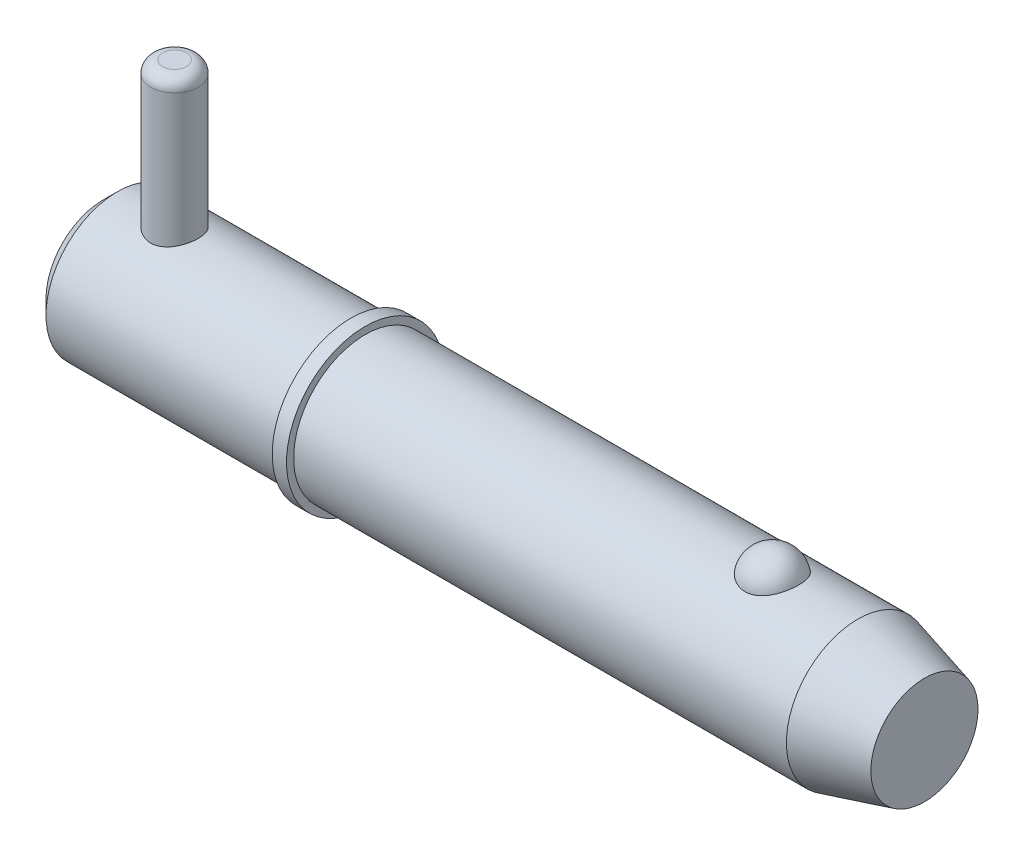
ISO-10303-21;
HEADER;
FILE_DESCRIPTION(('STEP AP214'),'2;1');
FILE_NAME('part.step','',(''),(''),'','','');
FILE_SCHEMA(('AUTOMOTIVE_DESIGN { 1 0 10303 214 1 1 1 1 }'));
ENDSEC;
DATA;
#1=APPLICATION_CONTEXT('core data for automotive mechanical design processes');
#2=APPLICATION_PROTOCOL_DEFINITION('international standard','automotive_design',2000,#1);
#3=PRODUCT_CONTEXT('',#1,'mechanical');
#4=PRODUCT('Part','Part','',(#3));
#5=PRODUCT_RELATED_PRODUCT_CATEGORY('part','',(#4));
#6=PRODUCT_DEFINITION_FORMATION('','',#4);
#7=PRODUCT_DEFINITION_CONTEXT('part definition',#1,'design');
#8=PRODUCT_DEFINITION('design','',#6,#7);
#9=PRODUCT_DEFINITION_SHAPE('','',#8);
#10=(LENGTH_UNIT() NAMED_UNIT(*) SI_UNIT(.MILLI.,.METRE.));
#11=(NAMED_UNIT(*) PLANE_ANGLE_UNIT() SI_UNIT($,.RADIAN.));
#12=(NAMED_UNIT(*) SI_UNIT($,.STERADIAN.) SOLID_ANGLE_UNIT());
#13=UNCERTAINTY_MEASURE_WITH_UNIT(LENGTH_MEASURE(1.E-05),#10,'distance_accuracy_value','');
#14=(GEOMETRIC_REPRESENTATION_CONTEXT(3) GLOBAL_UNCERTAINTY_ASSIGNED_CONTEXT((#13)) GLOBAL_UNIT_ASSIGNED_CONTEXT((#10,
#11,#12)) REPRESENTATION_CONTEXT('',''));
#15=CARTESIAN_POINT('',(0.,0.,0.));
#16=DIRECTION('',(0.,0.,1.));
#17=DIRECTION('',(1.,0.,0.));
#18=AXIS2_PLACEMENT_3D('',#15,#16,#17);
#19=CARTESIAN_POINT('',(9.525,28.575,0.));
#20=DIRECTION('',(0.,-1.,0.));
#21=DIRECTION('',(0.,0.,-1.));
#22=AXIS2_PLACEMENT_3D('',#19,#20,#21);
#23=CYLINDRICAL_SURFACE('',#22,3.175);
#24=CARTESIAN_POINT('',(9.525,-7.93750000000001,0.));
#25=DIRECTION('',(0.,1.,0.));
#26=DIRECTION('',(0.,0.,1.));
#27=AXIS2_PLACEMENT_3D('',#24,#25,#26);
#28=CIRCLE('',#27,3.175);
#29=CARTESIAN_POINT('',(9.525,-7.93750000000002,-3.175));
#30=VERTEX_POINT('',#29);
#31=EDGE_CURVE('P0_E25',#30,#30,#28,.T.);
#32=CARTESIAN_POINT('',(9.525,26.9875,0.));
#33=DIRECTION('',(0.,1.,0.));
#34=DIRECTION('',(0.,0.,1.));
#35=AXIS2_PLACEMENT_3D('',#32,#33,#34);
#36=CIRCLE('',#35,3.175);
#37=CARTESIAN_POINT('',(9.525,26.9875,-3.175));
#38=VERTEX_POINT('',#37);
#39=EDGE_CURVE('P0_E29',#38,#38,#36,.F.);
#40=CARTESIAN_POINT('',(9.525,-7.93750000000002,-3.175));
#41=CARTESIAN_POINT('',(9.525,-7.57369791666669,-3.175));
#42=CARTESIAN_POINT('',(9.525,-7.20989583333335,-3.175));
#43=CARTESIAN_POINT('',(9.525,-6.48229166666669,-3.175));
#44=CARTESIAN_POINT('',(9.525,-6.11848958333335,-3.175));
#45=CARTESIAN_POINT('',(9.525,-5.39088541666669,-3.175));
#46=CARTESIAN_POINT('',(9.525,-5.02708333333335,-3.175));
#47=CARTESIAN_POINT('',(9.525,-4.29947916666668,-3.175));
#48=CARTESIAN_POINT('',(9.525,-3.93567708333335,-3.175));
#49=CARTESIAN_POINT('',(9.525,-3.20807291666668,-3.175));
#50=CARTESIAN_POINT('',(9.525,-2.84427083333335,-3.175));
#51=CARTESIAN_POINT('',(9.525,-2.11666666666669,-3.175));
#52=CARTESIAN_POINT('',(9.525,-1.75286458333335,-3.175));
#53=CARTESIAN_POINT('',(9.525,-1.02526041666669,-3.175));
#54=CARTESIAN_POINT('',(9.525,-0.661458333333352,-3.175));
#55=CARTESIAN_POINT('',(9.525,0.0661458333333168,-3.175));
#56=CARTESIAN_POINT('',(9.525,0.429947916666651,-3.175));
#57=CARTESIAN_POINT('',(9.525,1.15755208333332,-3.175));
#58=CARTESIAN_POINT('',(9.525,1.52135416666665,-3.175));
#59=CARTESIAN_POINT('',(9.525,2.24895833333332,-3.175));
#60=CARTESIAN_POINT('',(9.525,2.61276041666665,-3.175));
#61=CARTESIAN_POINT('',(9.525,3.34036458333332,-3.175));
#62=CARTESIAN_POINT('',(9.525,3.70416666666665,-3.175));
#63=CARTESIAN_POINT('',(9.525,4.43177083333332,-3.175));
#64=CARTESIAN_POINT('',(9.525,4.79557291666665,-3.175));
#65=CARTESIAN_POINT('',(9.525,5.52317708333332,-3.175));
#66=CARTESIAN_POINT('',(9.525,5.88697916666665,-3.175));
#67=CARTESIAN_POINT('',(9.525,6.61458333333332,-3.175));
#68=CARTESIAN_POINT('',(9.525,6.97838541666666,-3.175));
#69=CARTESIAN_POINT('',(9.525,7.70598958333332,-3.175));
#70=CARTESIAN_POINT('',(9.525,8.06979166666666,-3.175));
#71=CARTESIAN_POINT('',(9.525,8.79739583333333,-3.175));
#72=CARTESIAN_POINT('',(9.525,9.16119791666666,-3.175));
#73=CARTESIAN_POINT('',(9.525,9.88880208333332,-3.175));
#74=CARTESIAN_POINT('',(9.525,10.2526041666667,-3.175));
#75=CARTESIAN_POINT('',(9.525,10.9802083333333,-3.175));
#76=CARTESIAN_POINT('',(9.525,11.3440104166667,-3.175));
#77=CARTESIAN_POINT('',(9.525,12.0716145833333,-3.175));
#78=CARTESIAN_POINT('',(9.525,12.4354166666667,-3.175));
#79=CARTESIAN_POINT('',(9.525,13.1630208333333,-3.175));
#80=CARTESIAN_POINT('',(9.525,13.5268229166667,-3.175));
#81=CARTESIAN_POINT('',(9.525,14.2544270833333,-3.175));
#82=CARTESIAN_POINT('',(9.525,14.6182291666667,-3.175));
#83=CARTESIAN_POINT('',(9.525,15.3458333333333,-3.175));
#84=CARTESIAN_POINT('',(9.525,15.7096354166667,-3.175));
#85=CARTESIAN_POINT('',(9.525,16.4372395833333,-3.175));
#86=CARTESIAN_POINT('',(9.525,16.8010416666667,-3.175));
#87=CARTESIAN_POINT('',(9.525,17.5286458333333,-3.175));
#88=CARTESIAN_POINT('',(9.525,17.8924479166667,-3.175));
#89=CARTESIAN_POINT('',(9.525,18.6200520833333,-3.175));
#90=CARTESIAN_POINT('',(9.525,18.9838541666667,-3.175));
#91=CARTESIAN_POINT('',(9.525,19.7114583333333,-3.175));
#92=CARTESIAN_POINT('',(9.525,20.0752604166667,-3.175));
#93=CARTESIAN_POINT('',(9.525,20.8028645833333,-3.175));
#94=CARTESIAN_POINT('',(9.525,21.1666666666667,-3.175));
#95=CARTESIAN_POINT('',(9.525,21.8942708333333,-3.175));
#96=CARTESIAN_POINT('',(9.525,22.2580729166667,-3.175));
#97=CARTESIAN_POINT('',(9.525,22.9856770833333,-3.175));
#98=CARTESIAN_POINT('',(9.525,23.3494791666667,-3.175));
#99=CARTESIAN_POINT('',(9.525,24.0770833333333,-3.175));
#100=CARTESIAN_POINT('',(9.525,24.4408854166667,-3.175));
#101=CARTESIAN_POINT('',(9.525,25.1684895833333,-3.175));
#102=CARTESIAN_POINT('',(9.525,25.5322916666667,-3.175));
#103=CARTESIAN_POINT('',(9.525,26.2598958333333,-3.175));
#104=CARTESIAN_POINT('',(9.525,26.6236979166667,-3.175));
#105=CARTESIAN_POINT('',(9.525,26.9875,-3.175));
#106=B_SPLINE_CURVE_WITH_KNOTS('',3,(#40,#41,#42,#43,#44,#45,#46,#47,#48,#49,#50,#51,#52,#53,
#54,#55,#56,#57,#58,#59,#60,#61,#62,#63,#64,#65,#66,#67,#68,#69,#70,#71,#72,#73,#74,#75,#76,#77,
#78,#79,#80,#81,#82,#83,#84,#85,#86,#87,#88,#89,#90,#91,#92,#93,#94,#95,#96,#97,#98,#99,#100,
#101,#102,#103,#104,#105),.UNSPECIFIED.,.F.,.F.,(4,2,2,2,2,2,2,2,2,2,2,2,2,2,2,2,2,2,2,2,2,2,2,
2,2,2,2,2,2,2,2,2,4),(0.,1.09140625,2.1828125,3.27421875,4.365625,5.45703125,6.5484375,
7.63984375,8.73125000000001,9.82265625,10.9140625,12.00546875,13.096875,14.18828125,15.2796875,
16.37109375,17.4625,18.55390625,19.6453125,20.73671875,21.828125,22.91953125,24.0109375,
25.10234375,26.19375,27.28515625,28.3765625,29.46796875,30.559375,31.65078125,32.7421875,
33.83359375,34.925),.UNSPECIFIED.);
#107=EDGE_CURVE('P0_BSEAM14',#30,#38,#106,.T.);
#108=ORIENTED_EDGE('',*,*,#31,.T.);
#109=ORIENTED_EDGE('',*,*,#39,.T.);
#110=ORIENTED_EDGE('',*,*,#107,.T.);
#111=ORIENTED_EDGE('',*,*,#107,.F.);
#112=EDGE_LOOP('',(#108,#110,#109,#111));
#113=FACE_BOUND('',#112,.T.);
#114=ADVANCED_FACE('P0_F14',(#113),#23,.T.);
#115=CARTESIAN_POINT('',(9.525,28.575,0.));
#116=DIRECTION('',(0.,1.,0.));
#117=DIRECTION('',(0.,0.,1.));
#118=AXIS2_PLACEMENT_3D('',#115,#116,#117);
#119=PLANE('',#118);
#120=CARTESIAN_POINT('',(9.525,28.575,0.));
#121=DIRECTION('',(0.,1.,0.));
#122=DIRECTION('',(0.,0.,1.));
#123=AXIS2_PLACEMENT_3D('',#120,#121,#122);
#124=CIRCLE('',#123,1.5875);
#125=CARTESIAN_POINT('',(9.525,28.575,1.5875));
#126=VERTEX_POINT('',#125);
#127=EDGE_CURVE('P0_E10',#126,#126,#124,.T.);
#128=ORIENTED_EDGE('',*,*,#127,.T.);
#129=EDGE_LOOP('',(#128));
#130=FACE_BOUND('',#129,.T.);
#131=ADVANCED_FACE('P0_F46',(#130),#119,.T.);
#132=CARTESIAN_POINT('',(9.525,-9.525,0.));
#133=DIRECTION('',(0.,1.,0.));
#134=DIRECTION('',(0.,0.,1.));
#135=AXIS2_PLACEMENT_3D('',#132,#133,#134);
#136=PLANE('',#135);
#137=CARTESIAN_POINT('',(9.525,-9.525,0.));
#138=DIRECTION('',(0.,1.,0.));
#139=DIRECTION('',(0.,0.,1.));
#140=AXIS2_PLACEMENT_3D('',#137,#138,#139);
#141=CIRCLE('',#140,1.5875);
#142=CARTESIAN_POINT('',(9.525,-9.525,1.5875));
#143=VERTEX_POINT('',#142);
#144=EDGE_CURVE('P0_E21',#143,#143,#141,.F.);
#145=ORIENTED_EDGE('',*,*,#144,.T.);
#146=EDGE_LOOP('',(#145));
#147=FACE_BOUND('',#146,.T.);
#148=ADVANCED_FACE('P0_F43',(#147),#136,.F.);
#149=CARTESIAN_POINT('',(9.525,-7.9375,0.));
#150=DIRECTION('',(0.,1.,0.));
#151=DIRECTION('',(0.,0.,1.));
#152=AXIS2_PLACEMENT_3D('',#149,#150,#151);
#153=DEGENERATE_TOROIDAL_SURFACE('',#152,1.5875,1.5875,.T.);
#154=ORIENTED_EDGE('',*,*,#144,.F.);
#155=EDGE_LOOP('',(#154));
#156=FACE_BOUND('',#155,.T.);
#157=ORIENTED_EDGE('',*,*,#31,.F.);
#158=EDGE_LOOP('',(#157));
#159=FACE_BOUND('',#158,.T.);
#160=ADVANCED_FACE('P0_F38',(#156,#159),#153,.T.);
#161=CARTESIAN_POINT('',(9.525,26.9875,0.));
#162=DIRECTION('',(0.,1.,0.));
#163=DIRECTION('',(0.,0.,1.));
#164=AXIS2_PLACEMENT_3D('',#161,#162,#163);
#165=DEGENERATE_TOROIDAL_SURFACE('',#164,1.5875,1.5875,.T.);
#166=ORIENTED_EDGE('',*,*,#39,.F.);
#167=EDGE_LOOP('',(#166));
#168=FACE_BOUND('',#167,.T.);
#169=ORIENTED_EDGE('',*,*,#127,.F.);
#170=EDGE_LOOP('',(#169));
#171=FACE_BOUND('',#170,.T.);
#172=ADVANCED_FACE('P0_F16',(#168,#171),#165,.T.);
#173=CLOSED_SHELL('',(#114,#131,#148,#160,#172));
#174=MANIFOLD_SOLID_BREP('P0_B1',#173);
#175=CARTESIAN_POINT('',(0.,0.,0.));
#176=DIRECTION('',(1.,0.,0.));
#177=DIRECTION('',(0.,0.,-1.));
#178=AXIS2_PLACEMENT_3D('',#175,#176,#177);
#179=CYLINDRICAL_SURFACE('',#178,9.525);
#180=CARTESIAN_POINT('',(100.643054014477,0.,0.));
#181=DIRECTION('',(1.,0.,0.));
#182=DIRECTION('',(0.,0.,-1.));
#183=AXIS2_PLACEMENT_3D('',#180,#181,#182);
#184=CIRCLE('',#183,9.525);
#185=CARTESIAN_POINT('',(100.643054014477,0.,-9.525));
#186=VERTEX_POINT('',#185);
#187=EDGE_CURVE('P1_E81',#186,#186,#184,.T.);
#188=ORIENTED_EDGE('',*,*,#187,.F.);
#189=EDGE_LOOP('',(#188));
#190=FACE_BOUND('',#189,.T.);
#191=CARTESIAN_POINT('',(34.93,0.,0.));
#192=DIRECTION('',(1.,0.,0.));
#193=DIRECTION('',(0.,0.,-1.));
#194=AXIS2_PLACEMENT_3D('',#191,#192,#193);
#195=CIRCLE('',#194,9.525);
#196=CARTESIAN_POINT('',(34.93,0.,-9.525));
#197=VERTEX_POINT('',#196);
#198=EDGE_CURVE('P1_E85',#197,#197,#195,.T.);
#199=ORIENTED_EDGE('',*,*,#198,.T.);
#200=EDGE_LOOP('',(#199));
#201=FACE_BOUND('',#200,.T.);
#202=CARTESIAN_POINT('',(89.2457573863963,8.80405803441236,3.63513233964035));
#203=CARTESIAN_POINT('',(89.1516766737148,8.80405953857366,3.63513053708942));
#204=CARTESIAN_POINT('',(89.0575618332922,8.80561325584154,3.6313746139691));
#205=CARTESIAN_POINT('',(88.8700126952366,8.81177748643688,3.61638665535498));
#206=CARTESIAN_POINT('',(88.7765788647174,8.81638992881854,3.60514990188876));
#207=CARTESIAN_POINT('',(88.4979452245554,8.8346711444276,3.56024627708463));
#208=CARTESIAN_POINT('',(88.3146916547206,8.85278327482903,3.51538626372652));
#209=CARTESIAN_POINT('',(87.9595099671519,8.89871214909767,3.39742145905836));
#210=CARTESIAN_POINT('',(87.7875533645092,8.9265032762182,3.32439116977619));
#211=CARTESIAN_POINT('',(87.458707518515,8.98874819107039,3.15220244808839));
#212=CARTESIAN_POINT('',(87.3018114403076,9.02319893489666,3.05305594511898));
#213=CARTESIAN_POINT('',(87.0022147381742,9.09629186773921,2.82797815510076));
#214=CARTESIAN_POINT('',(86.8600600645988,9.13502685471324,2.7013513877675));
#215=CARTESIAN_POINT('',(86.5982999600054,9.2118657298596,2.4264193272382));
#216=CARTESIAN_POINT('',(86.4787015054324,9.2499694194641,2.27810735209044));
#217=CARTESIAN_POINT('',(86.259645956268,9.3234108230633,1.95652290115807));
#218=CARTESIAN_POINT('',(86.1613174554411,9.35855090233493,1.78243511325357));
#219=CARTESIAN_POINT('',(85.9938190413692,9.42045142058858,1.41937246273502));
#220=CARTESIAN_POINT('',(85.9246511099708,9.44721128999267,1.23039658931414));
#221=CARTESIAN_POINT('',(85.8161994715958,9.48990641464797,0.840370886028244));
#222=CARTESIAN_POINT('',(85.7772880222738,9.50570658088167,0.639202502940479));
#223=CARTESIAN_POINT('',(85.7315550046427,9.52433146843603,0.232664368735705));
#224=CARTESIAN_POINT('',(85.7247324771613,9.52715657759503,0.0272947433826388));
#225=CARTESIAN_POINT('',(85.743255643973,9.51956918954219,-0.380478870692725));
#226=CARTESIAN_POINT('',(85.7684052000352,9.50923740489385,-0.58289331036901));
#227=CARTESIAN_POINT('',(85.8500253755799,9.47651897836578,-0.980293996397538));
#228=CARTESIAN_POINT('',(85.9064966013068,9.45413210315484,-1.17528009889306));
#229=CARTESIAN_POINT('',(86.0497192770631,9.39954044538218,-1.55263697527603));
#230=CARTESIAN_POINT('',(86.1365124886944,9.36732213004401,-1.73498993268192));
#231=CARTESIAN_POINT('',(86.3386103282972,9.29640700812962,-2.08177763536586));
#232=CARTESIAN_POINT('',(86.4539172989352,9.25770966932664,-2.24621090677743));
#233=CARTESIAN_POINT('',(86.711264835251,9.17775604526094,-2.5533833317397));
#234=CARTESIAN_POINT('',(86.8534344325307,9.136488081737,-2.696011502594));
#235=CARTESIAN_POINT('',(87.16089985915,9.05620497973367,-2.95451229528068));
#236=CARTESIAN_POINT('',(87.3261937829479,9.01718965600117,-3.07038711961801));
#237=CARTESIAN_POINT('',(87.672052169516,8.9468001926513,-3.26976836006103));
#238=CARTESIAN_POINT('',(87.8522278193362,8.91528408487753,-3.35389750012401));
#239=CARTESIAN_POINT('',(88.2256514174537,8.86272514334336,-3.49043503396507));
#240=CARTESIAN_POINT('',(88.4188944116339,8.8416783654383,-3.54285537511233));
#241=CARTESIAN_POINT('',(88.8025036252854,8.81348056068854,-3.61241306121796));
#242=CARTESIAN_POINT('',(88.9925251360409,8.80568348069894,-3.63119339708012));
#243=CARTESIAN_POINT('',(89.3731906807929,8.80289410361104,-3.63795342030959));
#244=CARTESIAN_POINT('',(89.5638345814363,8.80789922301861,-3.62593932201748));
#245=CARTESIAN_POINT('',(89.9340076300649,8.8297491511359,-3.57238430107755));
#246=CARTESIAN_POINT('',(90.1136976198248,8.84621463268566,-3.53178890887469));
#247=CARTESIAN_POINT('',(90.463422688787,8.88875330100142,-3.42331083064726));
#248=CARTESIAN_POINT('',(90.6334569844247,8.91482726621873,-3.35542593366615));
#249=CARTESIAN_POINT('',(90.9632377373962,8.97448239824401,-3.19248225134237));
#250=CARTESIAN_POINT('',(91.1226801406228,9.00821446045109,-3.09686474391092));
#251=CARTESIAN_POINT('',(91.4235136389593,9.07935398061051,-2.88162736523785));
#252=CARTESIAN_POINT('',(91.5649005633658,9.11676228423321,-2.76200196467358));
#253=CARTESIAN_POINT('',(91.8333193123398,9.19347419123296,-2.49516285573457));
#254=CARTESIAN_POINT('',(91.9592750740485,9.23277872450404,-2.34686614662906));
#255=CARTESIAN_POINT('',(92.1855227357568,9.30737610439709,-2.03093683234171));
#256=CARTESIAN_POINT('',(92.2858100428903,9.34266823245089,-1.86330077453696));
#257=CARTESIAN_POINT('',(92.4615149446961,9.40674710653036,-1.50744893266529));
#258=CARTESIAN_POINT('',(92.536041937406,9.4352917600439,-1.31874876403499));
#259=CARTESIAN_POINT('',(92.6541650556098,9.48144132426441,-0.930631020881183));
#260=CARTESIAN_POINT('',(92.6977608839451,9.49904612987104,-0.731213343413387));
#261=CARTESIAN_POINT('',(92.7531580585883,9.5215314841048,-0.327147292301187));
#262=CARTESIAN_POINT('',(92.7649354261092,9.52640243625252,-0.122495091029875));
#263=CARTESIAN_POINT('',(92.7563825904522,9.52289571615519,0.286018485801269));
#264=CARTESIAN_POINT('',(92.7360530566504,9.51451832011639,0.489879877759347));
#265=CARTESIAN_POINT('',(92.6638840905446,9.48544083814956,0.88999431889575));
#266=CARTESIAN_POINT('',(92.6121993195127,9.46480124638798,1.08627971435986));
#267=CARTESIAN_POINT('',(92.4784917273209,9.4133389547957,1.46682086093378));
#268=CARTESIAN_POINT('',(92.3964668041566,9.38251554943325,1.65107577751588));
#269=CARTESIAN_POINT('',(92.2031929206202,9.31365636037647,2.00346348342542));
#270=CARTESIAN_POINT('',(92.0917838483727,9.27558138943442,2.17150083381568));
#271=CARTESIAN_POINT('',(91.8422947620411,9.19638714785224,2.48563115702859));
#272=CARTESIAN_POINT('',(91.7042163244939,9.15526805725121,2.63172542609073));
#273=CARTESIAN_POINT('',(91.4048438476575,9.07465393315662,2.89750997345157));
#274=CARTESIAN_POINT('',(91.2436109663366,9.03515496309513,3.01726776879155));
#275=CARTESIAN_POINT('',(90.9016136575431,8.96227564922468,3.22732920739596));
#276=CARTESIAN_POINT('',(90.720841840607,8.92889763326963,3.31762165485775));
#277=CARTESIAN_POINT('',(90.3514451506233,8.8734538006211,3.46314419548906));
#278=CARTESIAN_POINT('',(90.1633237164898,8.85102983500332,3.51950082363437));
#279=CARTESIAN_POINT('',(89.8757869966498,8.8266696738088,3.57993683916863));
#280=CARTESIAN_POINT('',(89.7791339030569,8.82009725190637,3.59606217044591));
#281=CARTESIAN_POINT('',(89.5846770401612,8.81020897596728,3.62022512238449));
#282=CARTESIAN_POINT('',(89.4868741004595,8.80689090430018,3.62826825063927));
#283=CARTESIAN_POINT('',(89.3412243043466,8.80445615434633,3.63416760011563));
#284=CARTESIAN_POINT('',(89.2934952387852,8.80405727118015,3.63513325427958));
#285=CARTESIAN_POINT('',(89.2457573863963,8.80405803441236,3.63513233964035));
#286=B_SPLINE_CURVE_WITH_KNOTS('',3,(#202,#203,#204,#205,#206,#207,#208,#209,#210,#211,#212,
#213,#214,#215,#216,#217,#218,#219,#220,#221,#222,#223,#224,#225,#226,#227,#228,#229,#230,#231,
#232,#233,#234,#235,#236,#237,#238,#239,#240,#241,#242,#243,#244,#245,#246,#247,#248,#249,#250,
#251,#252,#253,#254,#255,#256,#257,#258,#259,#260,#261,#262,#263,#264,#265,#266,#267,#268,#269,
#270,#271,#272,#273,#274,#275,#276,#277,#278,#279,#280,#281,#282,#283,#284,#285),.UNSPECIFIED.,
.T.,.F.,(4,2,2,2,2,2,2,2,2,2,2,2,2,2,2,2,2,2,2,2,2,2,2,2,2,2,2,2,2,2,2,2,2,2,2,2,2,2,2,2,2,4),
(0.,0.282202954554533,0.564584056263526,1.13017050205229,1.69427128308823,2.258114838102,
2.83836627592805,3.41879688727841,4.02497117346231,4.63118665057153,5.24474754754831,
5.85829010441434,6.46808687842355,7.07789545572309,7.68854723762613,8.29924920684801,
8.91296283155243,9.52662591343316,10.1275338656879,10.7282152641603,11.2986646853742,
11.868998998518,12.4213015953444,12.973648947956,13.5380053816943,14.1024919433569,
14.695298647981,15.2882113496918,15.8999469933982,16.5116885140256,17.1238909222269,
17.7360805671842,18.3452748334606,18.9545113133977,19.567138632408,20.1797297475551,
20.7907316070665,21.4019653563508,21.9915938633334,22.2859053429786,22.5800161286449,
22.723209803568),.UNSPECIFIED.);
#287=CARTESIAN_POINT('',(89.2457573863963,8.80405803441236,3.63513233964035));
#288=VERTEX_POINT('',#287);
#289=EDGE_CURVE('P1_E35',#288,#288,#286,.T.);
#290=ORIENTED_EDGE('',*,*,#289,.T.);
#291=EDGE_LOOP('',(#290));
#292=FACE_BOUND('',#291,.T.);
#293=ADVANCED_FACE('P1_F13',(#190,#201,#292),#179,.T.);
#294=CARTESIAN_POINT('',(0.,0.,0.));
#295=DIRECTION('',(-1.,0.,0.));
#296=DIRECTION('',(0.,0.,1.));
#297=AXIS2_PLACEMENT_3D('',#294,#295,#296);
#298=PLANE('',#297);
#299=CARTESIAN_POINT('',(0.,0.,0.));
#300=DIRECTION('',(1.,0.,0.));
#301=DIRECTION('',(0.,0.,-1.));
#302=AXIS2_PLACEMENT_3D('',#299,#300,#301);
#303=CIRCLE('',#302,7.62);
#304=CARTESIAN_POINT('',(0.,0.,-7.62));
#305=VERTEX_POINT('',#304);
#306=EDGE_CURVE('P1_E9',#305,#305,#303,.T.);
#307=ORIENTED_EDGE('',*,*,#306,.F.);
#308=EDGE_LOOP('',(#307));
#309=FACE_BOUND('',#308,.T.);
#310=ADVANCED_FACE('P1_F15',(#309),#298,.T.);
#311=CARTESIAN_POINT('',(1.90499999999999,0.,0.));
#312=DIRECTION('',(1.,0.,0.));
#313=DIRECTION('',(0.,0.,-1.));
#314=AXIS2_PLACEMENT_3D('',#311,#312,#313);
#315=CONICAL_SURFACE('',#314,9.525,0.785398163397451);
#316=ORIENTED_EDGE('',*,*,#306,.T.);
#317=EDGE_LOOP('',(#316));
#318=FACE_BOUND('',#317,.T.);
#319=CARTESIAN_POINT('',(1.90499999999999,0.,0.));
#320=DIRECTION('',(1.,0.,0.));
#321=DIRECTION('',(0.,0.,-1.));
#322=AXIS2_PLACEMENT_3D('',#319,#320,#321);
#323=CIRCLE('',#322,9.525);
#324=CARTESIAN_POINT('',(1.90499999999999,0.,-9.525));
#325=VERTEX_POINT('',#324);
#326=EDGE_CURVE('P1_E26',#325,#325,#323,.T.);
#327=ORIENTED_EDGE('',*,*,#326,.F.);
#328=EDGE_LOOP('',(#327));
#329=FACE_BOUND('',#328,.T.);
#330=ADVANCED_FACE('P1_F77',(#318,#329),#315,.T.);
#331=CARTESIAN_POINT('',(0.,0.,0.));
#332=DIRECTION('',(1.,0.,0.));
#333=DIRECTION('',(0.,0.,-1.));
#334=AXIS2_PLACEMENT_3D('',#331,#332,#333);
#335=CYLINDRICAL_SURFACE('',#334,9.525);
#336=CARTESIAN_POINT('',(9.525,-8.98025612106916,3.175));
#337=CARTESIAN_POINT('',(9.35206354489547,-8.98025555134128,3.17500081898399));
#338=CARTESIAN_POINT('',(9.17913201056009,-8.98530617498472,3.16082293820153));
#339=CARTESIAN_POINT('',(8.83839221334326,-9.00485797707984,3.10467734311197));
#340=CARTESIAN_POINT('',(8.67058479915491,-9.0193607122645,3.06270505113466));
#341=CARTESIAN_POINT('',(8.34508461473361,-9.05599546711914,2.95260866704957));
#342=CARTESIAN_POINT('',(8.18737272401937,-9.07811252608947,2.88453582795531));
#343=CARTESIAN_POINT('',(7.88555684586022,-9.12746212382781,2.72434567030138));
#344=CARTESIAN_POINT('',(7.74145587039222,-9.1546957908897,2.63222304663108));
#345=CARTESIAN_POINT('',(7.46531411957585,-9.21240503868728,2.42268738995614));
#346=CARTESIAN_POINT('',(7.33388351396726,-9.24296141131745,2.30449228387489));
#347=CARTESIAN_POINT('',(7.09229340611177,-9.30319020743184,2.0478358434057));
#348=CARTESIAN_POINT('',(6.98213731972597,-9.33286248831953,1.90937126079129));
#349=CARTESIAN_POINT('',(6.78345450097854,-9.38891527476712,1.61164431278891));
#350=CARTESIAN_POINT('',(6.69556709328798,-9.41518969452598,1.45193356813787));
#351=CARTESIAN_POINT('',(6.54814671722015,-9.46053437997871,1.11896913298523));
#352=CARTESIAN_POINT('',(6.48860610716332,-9.47960658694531,0.945719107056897));
#353=CARTESIAN_POINT('',(6.40163866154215,-9.50782564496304,0.596991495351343));
#354=CARTESIAN_POINT('',(6.373166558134,-9.5172947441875,0.421801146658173));
#355=CARTESIAN_POINT('',(6.3458207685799,-9.52638456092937,0.068890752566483));
#356=CARTESIAN_POINT('',(6.34693945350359,-9.52600781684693,-0.108828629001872));
#357=CARTESIAN_POINT('',(6.37808050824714,-9.51566675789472,-0.454353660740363));
#358=CARTESIAN_POINT('',(6.4069675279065,-9.50607905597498,-0.622274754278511));
#359=CARTESIAN_POINT('',(6.490947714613,-9.47886621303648,-0.950732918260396));
#360=CARTESIAN_POINT('',(6.54604265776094,-9.46124052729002,-1.11126948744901));
#361=CARTESIAN_POINT('',(6.68153768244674,-9.41945253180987,-1.42288410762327));
#362=CARTESIAN_POINT('',(6.76226085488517,-9.3952073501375,-1.57381010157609));
#363=CARTESIAN_POINT('',(6.94645456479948,-9.34270397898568,-1.86030973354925));
#364=CARTESIAN_POINT('',(7.04993142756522,-9.31444467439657,-1.99587908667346));
#365=CARTESIAN_POINT('',(7.28241619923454,-9.25532159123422,-2.2545702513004));
#366=CARTESIAN_POINT('',(7.4123967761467,-9.22439783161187,-2.37680549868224));
#367=CARTESIAN_POINT('',(7.69127470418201,-9.1645528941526,-2.5980302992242));
#368=CARTESIAN_POINT('',(7.84017496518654,-9.13563202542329,-2.6970162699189));
#369=CARTESIAN_POINT('',(8.15547526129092,-9.08273917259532,-2.87016016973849));
#370=CARTESIAN_POINT('',(8.32209451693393,-9.05884361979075,-2.94394402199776));
#371=CARTESIAN_POINT('',(8.66638917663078,-9.01959241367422,-3.06210713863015));
#372=CARTESIAN_POINT('',(8.84405991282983,-9.00423318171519,-3.10649872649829));
#373=CARTESIAN_POINT('',(9.19682677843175,-8.98460345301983,-3.16281207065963));
#374=CARTESIAN_POINT('',(9.37167742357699,-8.9798639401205,-3.17610837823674));
#375=CARTESIAN_POINT('',(9.72113927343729,-8.9806993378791,-3.17374726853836));
#376=CARTESIAN_POINT('',(9.89575051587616,-8.98627237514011,-3.15809511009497));
#377=CARTESIAN_POINT('',(10.2335233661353,-9.00663737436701,-3.09951644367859));
#378=CARTESIAN_POINT('',(10.3968722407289,-9.02110608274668,-3.05754530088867));
#379=CARTESIAN_POINT('',(10.7141759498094,-9.05727657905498,-2.94866651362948));
#380=CARTESIAN_POINT('',(10.8681291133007,-9.07897964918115,-2.88175444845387));
#381=CARTESIAN_POINT('',(11.1676828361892,-9.12802586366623,-2.72248103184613));
#382=CARTESIAN_POINT('',(11.3128635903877,-9.1555260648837,-2.62937980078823));
#383=CARTESIAN_POINT('',(11.5860387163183,-9.21276315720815,-2.42120937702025));
#384=CARTESIAN_POINT('',(11.7140280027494,-9.24250070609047,-2.30613370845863));
#385=CARTESIAN_POINT('',(11.9555513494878,-9.30259247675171,-2.05070616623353));
#386=CARTESIAN_POINT('',(12.0680936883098,-9.33290753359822,-1.90940458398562));
#387=CARTESIAN_POINT('',(12.267933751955,-9.3893275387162,-1.60917665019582));
#388=CARTESIAN_POINT('',(12.3552323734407,-9.41543263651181,-1.45025092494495));
#389=CARTESIAN_POINT('',(12.5013088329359,-9.46036988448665,-1.12007606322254));
#390=CARTESIAN_POINT('',(12.5602723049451,-9.47924920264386,-0.9489158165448));
#391=CARTESIAN_POINT('',(12.6483355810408,-9.50781089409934,-0.598355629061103));
#392=CARTESIAN_POINT('',(12.6774461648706,-9.5174965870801,-0.4189586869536));
#393=CARTESIAN_POINT('',(12.7040070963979,-9.52632915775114,-0.066088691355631));
#394=CARTESIAN_POINT('',(12.7028811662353,-9.52594996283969,0.107266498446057));
#395=CARTESIAN_POINT('',(12.6725130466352,-9.51586223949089,0.451202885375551));
#396=CARTESIAN_POINT('',(12.643273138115,-9.50615446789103,0.621784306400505));
#397=CARTESIAN_POINT('',(12.5584514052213,-9.47867404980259,0.952633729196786));
#398=CARTESIAN_POINT('',(12.5032953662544,-9.46103195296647,1.1130225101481));
#399=CARTESIAN_POINT('',(12.3686013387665,-9.41949985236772,1.42233126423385));
#400=CARTESIAN_POINT('',(12.2890589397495,-9.39560871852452,1.57124915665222));
#401=CARTESIAN_POINT('',(12.1044667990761,-9.34294133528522,1.85938800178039));
#402=CARTESIAN_POINT('',(11.9985831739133,-9.31401720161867,1.9980473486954));
#403=CARTESIAN_POINT('',(11.7657327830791,-9.25490239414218,2.25609475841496));
#404=CARTESIAN_POINT('',(11.6387592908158,-9.22471131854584,2.37547664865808));
#405=CARTESIAN_POINT('',(11.3613902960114,-9.16505913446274,2.59633024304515));
#406=CARTESIAN_POINT('',(11.2102725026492,-9.13567286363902,2.69691791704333));
#407=CARTESIAN_POINT('',(10.8923631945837,-9.08241113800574,2.87119803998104));
#408=CARTESIAN_POINT('',(10.7255757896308,-9.05853424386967,2.94489751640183));
#409=CARTESIAN_POINT('',(10.3887212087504,-9.02021736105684,3.06020415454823));
#410=CARTESIAN_POINT('',(10.219143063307,-9.00539959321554,3.10311136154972));
#411=CARTESIAN_POINT('',(9.87470703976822,-8.98542092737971,3.16050396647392));
#412=CARTESIAN_POINT('',(9.699851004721,-8.98025669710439,3.17499917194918));
#413=CARTESIAN_POINT('',(9.525,-8.98025612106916,3.175));
#414=B_SPLINE_CURVE_WITH_KNOTS('',3,(#336,#337,#338,#339,#340,#341,#342,#343,#344,#345,#346,
#347,#348,#349,#350,#351,#352,#353,#354,#355,#356,#357,#358,#359,#360,#361,#362,#363,#364,#365,
#366,#367,#368,#369,#370,#371,#372,#373,#374,#375,#376,#377,#378,#379,#380,#381,#382,#383,#384,
#385,#386,#387,#388,#389,#390,#391,#392,#393,#394,#395,#396,#397,#398,#399,#400,#401,#402,#403,
#404,#405,#406,#407,#408,#409,#410,#411,#412,#413),.UNSPECIFIED.,.T.,.F.,(4,2,2,2,2,2,2,2,2,2,2,
2,2,2,2,2,2,2,2,2,2,2,2,2,2,2,2,2,2,2,2,2,2,2,2,2,2,2,4),(0.,0.518161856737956,1.03640907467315,
1.55364379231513,2.07099270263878,2.60671746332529,3.14252816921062,3.69231882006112,
4.24196117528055,4.77247962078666,5.30286129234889,5.81244090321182,6.32205505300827,
6.83836754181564,7.3548237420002,7.89559553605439,8.43645060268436,8.98501631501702,
9.53335188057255,10.056948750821,10.5804505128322,11.0859695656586,11.5915782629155,
12.1132237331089,12.6350231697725,13.1819271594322,13.7288117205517,14.2720628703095,
14.815117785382,15.3326491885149,15.8501386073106,16.3594083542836,16.868770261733,
17.3969527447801,17.925304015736,18.4743376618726,19.023227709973,19.5473069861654,
20.0712053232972),.UNSPECIFIED.);
#415=CARTESIAN_POINT('',(9.525,-8.98025612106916,3.175));
#416=VERTEX_POINT('',#415);
#417=EDGE_CURVE('P1_E17',#416,#416,#414,.T.);
#418=ORIENTED_EDGE('',*,*,#417,.F.);
#419=EDGE_LOOP('',(#418));
#420=FACE_BOUND('',#419,.T.);
#421=CARTESIAN_POINT('',(9.525,8.98025612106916,3.175));
#422=CARTESIAN_POINT('',(9.69793645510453,8.98025555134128,3.17500081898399));
#423=CARTESIAN_POINT('',(9.87086798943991,8.98530617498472,3.16082293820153));
#424=CARTESIAN_POINT('',(10.2116077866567,9.00485797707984,3.10467734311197));
#425=CARTESIAN_POINT('',(10.3794152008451,9.0193607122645,3.06270505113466));
#426=CARTESIAN_POINT('',(10.7049153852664,9.05599546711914,2.95260866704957));
#427=CARTESIAN_POINT('',(10.8626272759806,9.07811252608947,2.88453582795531));
#428=CARTESIAN_POINT('',(11.1644431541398,9.12746212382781,2.72434567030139));
#429=CARTESIAN_POINT('',(11.3085441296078,9.15469579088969,2.63222304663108));
#430=CARTESIAN_POINT('',(11.5846858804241,9.21240503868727,2.42268738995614));
#431=CARTESIAN_POINT('',(11.7161164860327,9.24296141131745,2.30449228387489));
#432=CARTESIAN_POINT('',(11.9577065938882,9.30319020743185,2.0478358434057));
#433=CARTESIAN_POINT('',(12.067862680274,9.33286248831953,1.90937126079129));
#434=CARTESIAN_POINT('',(12.2665454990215,9.38891527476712,1.61164431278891));
#435=CARTESIAN_POINT('',(12.354432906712,9.41518969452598,1.45193356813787));
#436=CARTESIAN_POINT('',(12.5018532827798,9.46053437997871,1.11896913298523));
#437=CARTESIAN_POINT('',(12.5613938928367,9.47960658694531,0.945719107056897));
#438=CARTESIAN_POINT('',(12.6483613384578,9.50782564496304,0.596991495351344));
#439=CARTESIAN_POINT('',(12.676833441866,9.5172947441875,0.421801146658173));
#440=CARTESIAN_POINT('',(12.7041792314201,9.52638456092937,0.0688907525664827));
#441=CARTESIAN_POINT('',(12.7030605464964,9.52600781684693,-0.108828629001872));
#442=CARTESIAN_POINT('',(12.6719194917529,9.51566675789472,-0.454353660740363));
#443=CARTESIAN_POINT('',(12.6430324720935,9.50607905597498,-0.622274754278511));
#444=CARTESIAN_POINT('',(12.559052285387,9.47886621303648,-0.950732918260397));
#445=CARTESIAN_POINT('',(12.5039573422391,9.46124052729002,-1.11126948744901));
#446=CARTESIAN_POINT('',(12.3684623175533,9.41945253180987,-1.42288410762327));
#447=CARTESIAN_POINT('',(12.2877391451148,9.3952073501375,-1.57381010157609));
#448=CARTESIAN_POINT('',(12.1035454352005,9.34270397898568,-1.86030973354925));
#449=CARTESIAN_POINT('',(12.0000685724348,9.31444467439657,-1.99587908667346));
#450=CARTESIAN_POINT('',(11.7675838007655,9.25532159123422,-2.2545702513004));
#451=CARTESIAN_POINT('',(11.6376032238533,9.22439783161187,-2.37680549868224));
#452=CARTESIAN_POINT('',(11.358725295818,9.1645528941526,-2.5980302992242));
#453=CARTESIAN_POINT('',(11.2098250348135,9.13563202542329,-2.6970162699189));
#454=CARTESIAN_POINT('',(10.8945247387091,9.08273917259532,-2.87016016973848));
#455=CARTESIAN_POINT('',(10.7279054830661,9.05884361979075,-2.94394402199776));
#456=CARTESIAN_POINT('',(10.3836108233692,9.01959241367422,-3.06210713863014));
#457=CARTESIAN_POINT('',(10.2059400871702,9.00423318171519,-3.10649872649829));
#458=CARTESIAN_POINT('',(9.85317322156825,8.98460345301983,-3.16281207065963));
#459=CARTESIAN_POINT('',(9.67832257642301,8.9798639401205,-3.17610837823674));
#460=CARTESIAN_POINT('',(9.32886072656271,8.9806993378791,-3.17374726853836));
#461=CARTESIAN_POINT('',(9.15424948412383,8.98627237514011,-3.15809511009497));
#462=CARTESIAN_POINT('',(8.81647663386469,9.00663737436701,-3.09951644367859));
#463=CARTESIAN_POINT('',(8.65312775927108,9.02110608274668,-3.05754530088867));
#464=CARTESIAN_POINT('',(8.33582405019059,9.05727657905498,-2.94866651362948));
#465=CARTESIAN_POINT('',(8.18187088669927,9.07897964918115,-2.88175444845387));
#466=CARTESIAN_POINT('',(7.88231716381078,9.12802586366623,-2.72248103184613));
#467=CARTESIAN_POINT('',(7.73713640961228,9.1555260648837,-2.62937980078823));
#468=CARTESIAN_POINT('',(7.46396128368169,9.21276315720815,-2.42120937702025));
#469=CARTESIAN_POINT('',(7.33597199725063,9.24250070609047,-2.30613370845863));
#470=CARTESIAN_POINT('',(7.09444865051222,9.30259247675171,-2.05070616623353));
#471=CARTESIAN_POINT('',(6.98190631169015,9.33290753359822,-1.90940458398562));
#472=CARTESIAN_POINT('',(6.78206624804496,9.3893275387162,-1.60917665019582));
#473=CARTESIAN_POINT('',(6.6947676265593,9.41543263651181,-1.45025092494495));
#474=CARTESIAN_POINT('',(6.54869116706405,9.46036988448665,-1.12007606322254));
#475=CARTESIAN_POINT('',(6.48972769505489,9.47924920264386,-0.948915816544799));
#476=CARTESIAN_POINT('',(6.40166441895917,9.50781089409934,-0.598355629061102));
#477=CARTESIAN_POINT('',(6.3725538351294,9.5174965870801,-0.418958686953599));
#478=CARTESIAN_POINT('',(6.34599290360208,9.52632915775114,-0.0660886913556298));
#479=CARTESIAN_POINT('',(6.3471188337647,9.52594996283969,0.107266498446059));
#480=CARTESIAN_POINT('',(6.37748695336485,9.51586223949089,0.451202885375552));
#481=CARTESIAN_POINT('',(6.40672686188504,9.50615446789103,0.621784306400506));
#482=CARTESIAN_POINT('',(6.49154859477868,9.47867404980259,0.952633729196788));
#483=CARTESIAN_POINT('',(6.54670463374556,9.46103195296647,1.11302251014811));
#484=CARTESIAN_POINT('',(6.68139866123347,9.41949985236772,1.42233126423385));
#485=CARTESIAN_POINT('',(6.76094106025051,9.39560871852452,1.57124915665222));
#486=CARTESIAN_POINT('',(6.94553320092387,9.34294133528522,1.85938800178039));
#487=CARTESIAN_POINT('',(7.05141682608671,9.31401720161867,1.9980473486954));
#488=CARTESIAN_POINT('',(7.28426721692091,9.25490239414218,2.25609475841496));
#489=CARTESIAN_POINT('',(7.41124070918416,9.22471131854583,2.37547664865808));
#490=CARTESIAN_POINT('',(7.68860970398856,9.16505913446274,2.59633024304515));
#491=CARTESIAN_POINT('',(7.83972749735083,9.13567286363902,2.69691791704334));
#492=CARTESIAN_POINT('',(8.15763680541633,9.08241113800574,2.87119803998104));
#493=CARTESIAN_POINT('',(8.32442421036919,9.05853424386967,2.94489751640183));
#494=CARTESIAN_POINT('',(8.66127879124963,9.02021736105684,3.06020415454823));
#495=CARTESIAN_POINT('',(8.83085693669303,9.00539959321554,3.10311136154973));
#496=CARTESIAN_POINT('',(9.17529296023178,8.98542092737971,3.16050396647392));
#497=CARTESIAN_POINT('',(9.350148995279,8.98025669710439,3.17499917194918));
#498=CARTESIAN_POINT('',(9.525,8.98025612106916,3.175));
#499=B_SPLINE_CURVE_WITH_KNOTS('',3,(#421,#422,#423,#424,#425,#426,#427,#428,#429,#430,#431,
#432,#433,#434,#435,#436,#437,#438,#439,#440,#441,#442,#443,#444,#445,#446,#447,#448,#449,#450,
#451,#452,#453,#454,#455,#456,#457,#458,#459,#460,#461,#462,#463,#464,#465,#466,#467,#468,#469,
#470,#471,#472,#473,#474,#475,#476,#477,#478,#479,#480,#481,#482,#483,#484,#485,#486,#487,#488,
#489,#490,#491,#492,#493,#494,#495,#496,#497,#498),.UNSPECIFIED.,.T.,.F.,(4,2,2,2,2,2,2,2,2,2,2,
2,2,2,2,2,2,2,2,2,2,2,2,2,2,2,2,2,2,2,2,2,2,2,2,2,2,2,4),(0.,0.518161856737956,1.03640907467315,
1.55364379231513,2.07099270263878,2.60671746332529,3.14252816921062,3.69231882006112,
4.24196117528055,4.77247962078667,5.30286129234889,5.81244090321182,6.32205505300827,
6.83836754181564,7.3548237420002,7.89559553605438,8.43645060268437,8.98501631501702,
9.53335188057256,10.056948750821,10.5804505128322,11.0859695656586,11.5915782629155,
12.1132237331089,12.6350231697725,13.1819271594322,13.7288117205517,14.2720628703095,
14.815117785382,15.3326491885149,15.8501386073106,16.3594083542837,16.868770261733,
17.3969527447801,17.9253040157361,18.4743376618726,19.023227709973,19.5473069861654,
20.0712053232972),.UNSPECIFIED.);
#500=CARTESIAN_POINT('',(9.525,8.98025612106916,3.175));
#501=VERTEX_POINT('',#500);
#502=EDGE_CURVE('P1_E43',#501,#501,#499,.T.);
#503=ORIENTED_EDGE('',*,*,#502,.F.);
#504=EDGE_LOOP('',(#503));
#505=FACE_BOUND('',#504,.T.);
#506=ORIENTED_EDGE('',*,*,#326,.T.);
#507=EDGE_LOOP('',(#506));
#508=FACE_BOUND('',#507,.T.);
#509=CARTESIAN_POINT('',(33.025,0.,0.));
#510=DIRECTION('',(1.,0.,0.));
#511=DIRECTION('',(0.,0.,-1.));
#512=AXIS2_PLACEMENT_3D('',#509,#510,#511);
#513=CIRCLE('',#512,9.525);
#514=CARTESIAN_POINT('',(33.025,0.,-9.525));
#515=VERTEX_POINT('',#514);
#516=EDGE_CURVE('P1_E31',#515,#515,#513,.T.);
#517=ORIENTED_EDGE('',*,*,#516,.F.);
#518=EDGE_LOOP('',(#517));
#519=FACE_BOUND('',#518,.T.);
#520=ADVANCED_FACE('P1_F103',(#420,#505,#508,#519),#335,.T.);
#521=CARTESIAN_POINT('',(33.025,9.525,0.));
#522=DIRECTION('',(-1.,0.,0.));
#523=DIRECTION('',(0.,0.,1.));
#524=AXIS2_PLACEMENT_3D('',#521,#522,#523);
#525=PLANE('',#524);
#526=ORIENTED_EDGE('',*,*,#516,.T.);
#527=EDGE_LOOP('',(#526));
#528=FACE_BOUND('',#527,.T.);
#529=CARTESIAN_POINT('',(33.025,0.,0.));
#530=DIRECTION('',(1.,0.,0.));
#531=DIRECTION('',(0.,0.,-1.));
#532=AXIS2_PLACEMENT_3D('',#529,#530,#531);
#533=CIRCLE('',#532,10.4775);
#534=CARTESIAN_POINT('',(33.025,0.,-10.4775));
#535=VERTEX_POINT('',#534);
#536=EDGE_CURVE('P1_E91',#535,#535,#533,.T.);
#537=ORIENTED_EDGE('',*,*,#536,.F.);
#538=EDGE_LOOP('',(#537));
#539=FACE_BOUND('',#538,.T.);
#540=ADVANCED_FACE('P1_F100',(#528,#539),#525,.T.);
#541=CARTESIAN_POINT('',(0.,0.,0.));
#542=DIRECTION('',(1.,0.,0.));
#543=DIRECTION('',(0.,0.,-1.));
#544=AXIS2_PLACEMENT_3D('',#541,#542,#543);
#545=CYLINDRICAL_SURFACE('',#544,10.4775);
#546=ORIENTED_EDGE('',*,*,#536,.T.);
#547=EDGE_LOOP('',(#546));
#548=FACE_BOUND('',#547,.T.);
#549=CARTESIAN_POINT('',(34.93,0.,0.));
#550=DIRECTION('',(1.,0.,0.));
#551=DIRECTION('',(0.,0.,-1.));
#552=AXIS2_PLACEMENT_3D('',#549,#550,#551);
#553=CIRCLE('',#552,10.4775);
#554=CARTESIAN_POINT('',(34.93,0.,-10.4775));
#555=VERTEX_POINT('',#554);
#556=EDGE_CURVE('P1_E88',#555,#555,#553,.T.);
#557=ORIENTED_EDGE('',*,*,#556,.F.);
#558=EDGE_LOOP('',(#557));
#559=FACE_BOUND('',#558,.T.);
#560=ADVANCED_FACE('P1_F68',(#548,#559),#545,.T.);
#561=CARTESIAN_POINT('',(34.93,10.4775,0.));
#562=DIRECTION('',(1.,0.,0.));
#563=DIRECTION('',(0.,0.,-1.));
#564=AXIS2_PLACEMENT_3D('',#561,#562,#563);
#565=PLANE('',#564);
#566=ORIENTED_EDGE('',*,*,#556,.T.);
#567=EDGE_LOOP('',(#566));
#568=FACE_BOUND('',#567,.T.);
#569=ORIENTED_EDGE('',*,*,#198,.F.);
#570=EDGE_LOOP('',(#569));
#571=FACE_BOUND('',#570,.T.);
#572=ADVANCED_FACE('P1_F62',(#568,#571),#565,.T.);
#573=CARTESIAN_POINT('',(109.53,0.,0.));
#574=DIRECTION('',(-1.,0.,0.));
#575=DIRECTION('',(0.,0.,1.));
#576=AXIS2_PLACEMENT_3D('',#573,#574,#575);
#577=CONICAL_SURFACE('',#576,7.14375000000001,0.26179938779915);
#578=ORIENTED_EDGE('',*,*,#187,.T.);
#579=EDGE_LOOP('',(#578));
#580=FACE_BOUND('',#579,.T.);
#581=CARTESIAN_POINT('',(109.53,0.,0.));
#582=DIRECTION('',(1.,0.,0.));
#583=DIRECTION('',(0.,0.,-1.));
#584=AXIS2_PLACEMENT_3D('',#581,#582,#583);
#585=CIRCLE('',#584,7.14375000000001);
#586=CARTESIAN_POINT('',(109.53,0.,-7.14375000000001));
#587=VERTEX_POINT('',#586);
#588=EDGE_CURVE('P1_E42',#587,#587,#585,.T.);
#589=ORIENTED_EDGE('',*,*,#588,.F.);
#590=EDGE_LOOP('',(#589));
#591=FACE_BOUND('',#590,.T.);
#592=ADVANCED_FACE('P1_F59',(#580,#591),#577,.T.);
#593=CARTESIAN_POINT('',(109.53,7.14375000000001,0.));
#594=DIRECTION('',(1.,0.,0.));
#595=DIRECTION('',(0.,0.,-1.));
#596=AXIS2_PLACEMENT_3D('',#593,#594,#595);
#597=PLANE('',#596);
#598=ORIENTED_EDGE('',*,*,#588,.T.);
#599=EDGE_LOOP('',(#598));
#600=FACE_BOUND('',#599,.T.);
#601=ADVANCED_FACE('P1_F55',(#600),#597,.T.);
#602=CARTESIAN_POINT('',(89.2457573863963,8.57249999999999,0.));
#603=DIRECTION('',(-1.,0.,0.));
#604=DIRECTION('',(0.,1.,0.));
#605=AXIS2_PLACEMENT_3D('',#602,#603,#604);
#606=SPHERICAL_SURFACE('',#605,3.64250000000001);
#607=ORIENTED_EDGE('',*,*,#289,.F.);
#608=EDGE_LOOP('',(#607));
#609=FACE_BOUND('',#608,.T.);
#610=ADVANCED_FACE('P1_F50',(#609),#606,.T.);
#611=CARTESIAN_POINT('',(9.525,-10.4775,0.));
#612=DIRECTION('',(0.,1.,0.));
#613=DIRECTION('',(0.,0.,1.));
#614=AXIS2_PLACEMENT_3D('',#611,#612,#613);
#615=CYLINDRICAL_SURFACE('',#614,3.175);
#616=ORIENTED_EDGE('',*,*,#417,.T.);
#617=EDGE_LOOP('',(#616));
#618=FACE_BOUND('',#617,.T.);
#619=ORIENTED_EDGE('',*,*,#502,.T.);
#620=EDGE_LOOP('',(#619));
#621=FACE_BOUND('',#620,.T.);
#622=ADVANCED_FACE('P1_F54',(#618,#621),#615,.F.);
#623=CLOSED_SHELL('',(#293,#310,#330,#520,#540,#560,#572,#592,#601,#610,#622));
#624=MANIFOLD_SOLID_BREP('P1_B1',#623);
#625=ADVANCED_BREP_SHAPE_REPRESENTATION('',(#18,#174,#624),#14);
#626=SHAPE_DEFINITION_REPRESENTATION(#9,#625);
ENDSEC;
END-ISO-10303-21;
